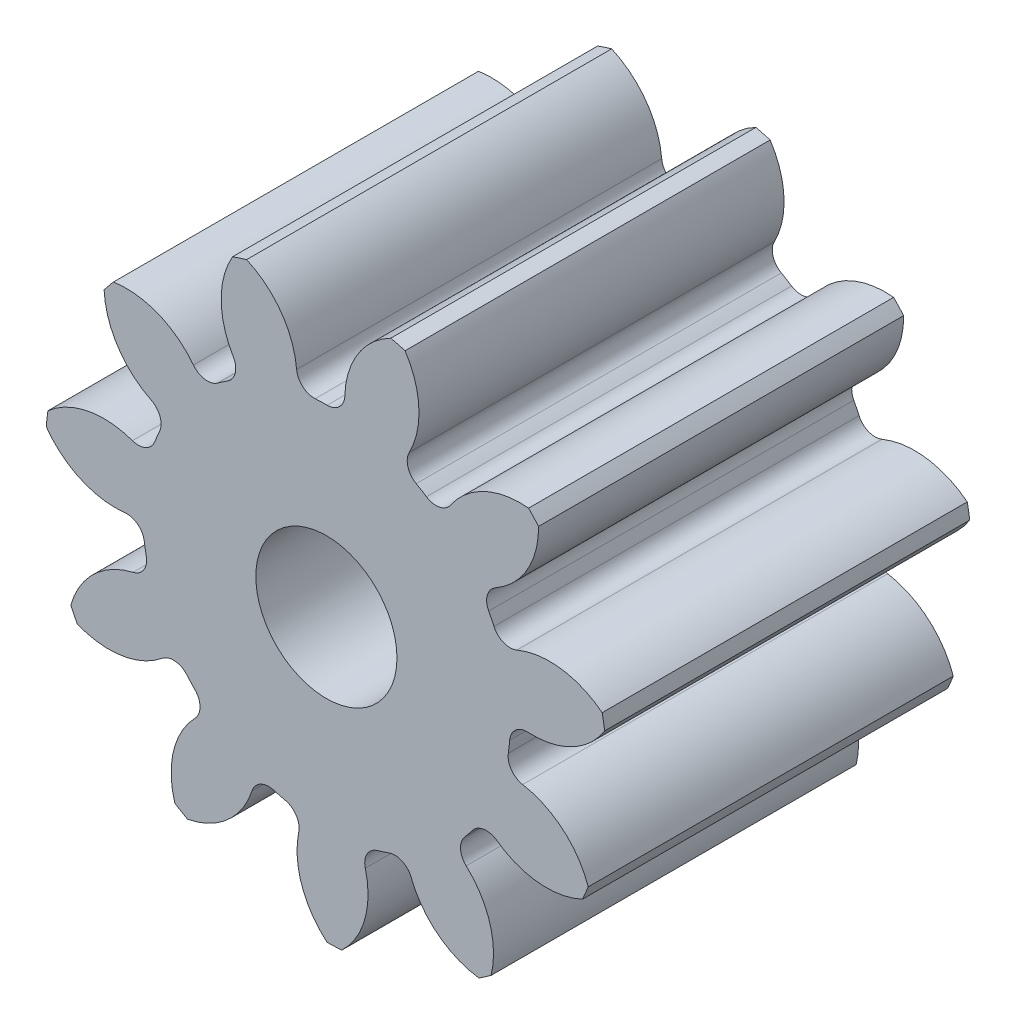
from build123d import *

# Parameters (mm, degrees)
SKETCH3_R         = 73.377777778
GEARBODY_DEPTH    = 95.25
TOOTHCUT_DEPTH    = 141.85864916
CIRPATTERN1_COUNT = 11
BOREDIA_R         = 18.415
BORE_DEPTH        = 12700


with BuildPart() as part:
    # Sketch3 → gearBody (new body)
    with BuildSketch(Plane.XY):
        Circle(SKETCH3_R)
    extrude(amount=GEARBODY_DEPTH)

    # Sketch2 → toothCut (cut, through all)
    with BuildSketch(Plane.XY):
        with BuildLine():
            ThreePointArc((47.460075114, -7.029113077), (47.663470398, -5.482768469), (47.816496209, -3.930629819))
            ThreePointArc((47.816496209, -3.930629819), (49.379470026, -0.841077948), (52.655287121, 0.280189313))
            ThreePointArc((52.655287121, 0.280189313), (64.715481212, 3.072966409), (73.377777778, 11.91674974))
            ThreePointArc((73.377777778, 11.91674974), (73.852133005, -8.495272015), (68.755470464, -28.266454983))
            ThreePointArc((68.755470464, -28.266454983), (62.327465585, -17.686821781), (51.21638682, -12.22863398))
            ThreePointArc((51.21638682, -12.22863398), (48.280721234, -10.392854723), (47.460075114, -7.029113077))
        make_face()
    toothcut = extrude(amount=TOOTHCUT_DEPTH, mode=Mode.SUBTRACT)

    # CirPattern1: toothCut ×11 about axis
    cirpattern1_axis = Axis((0, 0, 0), (0, 0, 1))
    for i in range(1, CIRPATTERN1_COUNT):
        add(toothcut.rotate(cirpattern1_axis, i * 360 / CIRPATTERN1_COUNT), mode=Mode.SUBTRACT)

    # boreDia → bore (cut, symmetric)
    with BuildSketch(Plane.XY):
        Circle(BOREDIA_R)
    extrude(amount=BORE_DEPTH, both=True, mode=Mode.SUBTRACT)


solid = part.part
